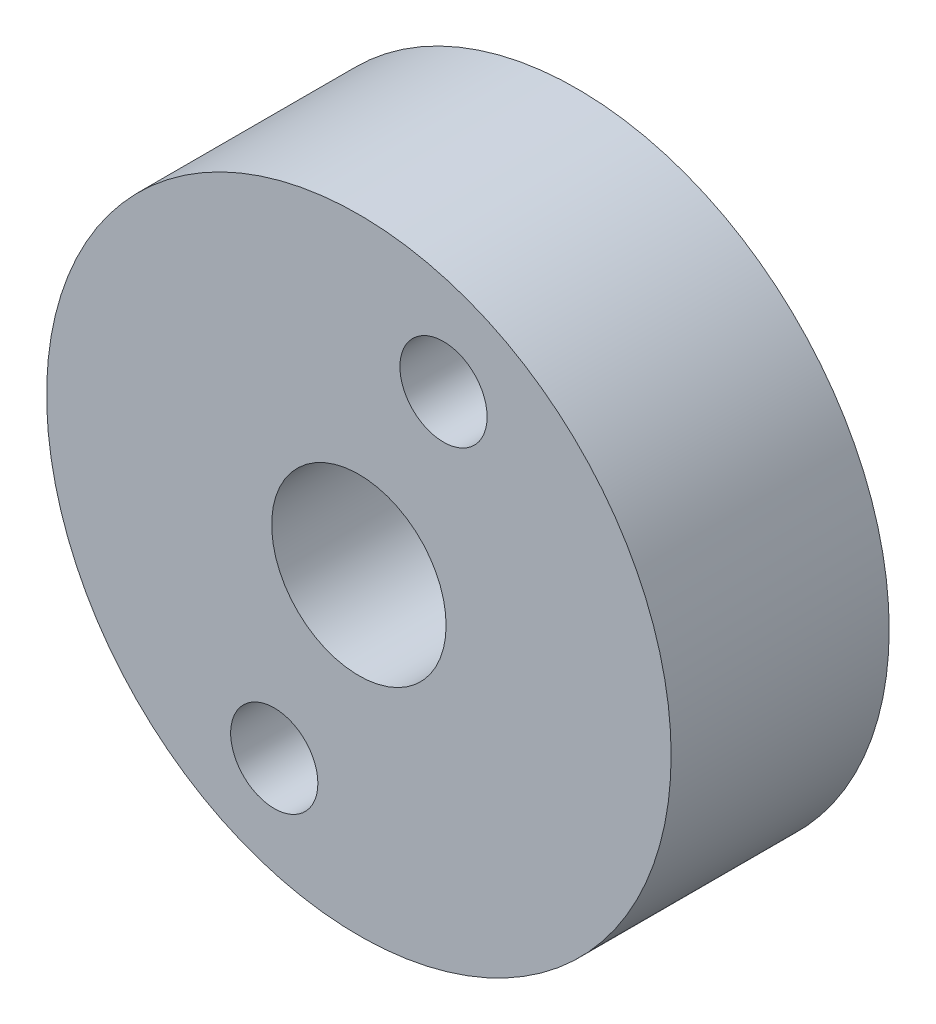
ISO-10303-21;
HEADER;
FILE_DESCRIPTION(('STEP AP214'),'2;1');
FILE_NAME('part.step','',(''),(''),'','','');
FILE_SCHEMA(('AUTOMOTIVE_DESIGN { 1 0 10303 214 1 1 1 1 }'));
ENDSEC;
DATA;
#1=APPLICATION_CONTEXT('core data for automotive mechanical design processes');
#2=APPLICATION_PROTOCOL_DEFINITION('international standard','automotive_design',2000,#1);
#3=PRODUCT_CONTEXT('',#1,'mechanical');
#4=PRODUCT('Part','Part','',(#3));
#5=PRODUCT_RELATED_PRODUCT_CATEGORY('part','',(#4));
#6=PRODUCT_DEFINITION_FORMATION('','',#4);
#7=PRODUCT_DEFINITION_CONTEXT('part definition',#1,'design');
#8=PRODUCT_DEFINITION('design','',#6,#7);
#9=PRODUCT_DEFINITION_SHAPE('','',#8);
#10=(LENGTH_UNIT() NAMED_UNIT(*) SI_UNIT(.MILLI.,.METRE.));
#11=(NAMED_UNIT(*) PLANE_ANGLE_UNIT() SI_UNIT($,.RADIAN.));
#12=(NAMED_UNIT(*) SI_UNIT($,.STERADIAN.) SOLID_ANGLE_UNIT());
#13=UNCERTAINTY_MEASURE_WITH_UNIT(LENGTH_MEASURE(1.E-05),#10,'distance_accuracy_value','');
#14=(GEOMETRIC_REPRESENTATION_CONTEXT(3) GLOBAL_UNCERTAINTY_ASSIGNED_CONTEXT((#13)) GLOBAL_UNIT_ASSIGNED_CONTEXT((#10,
#11,#12)) REPRESENTATION_CONTEXT('',''));
#15=CARTESIAN_POINT('',(0.,0.,0.));
#16=DIRECTION('',(0.,0.,1.));
#17=DIRECTION('',(1.,0.,0.));
#18=AXIS2_PLACEMENT_3D('',#15,#16,#17);
#19=CARTESIAN_POINT('',(0.,0.,5.));
#20=DIRECTION('',(0.,0.,-1.));
#21=DIRECTION('',(-1.,0.,0.));
#22=AXIS2_PLACEMENT_3D('',#19,#20,#21);
#23=CYLINDRICAL_SURFACE('',#22,7.16);
#24=CARTESIAN_POINT('',(0.,0.,5.));
#25=DIRECTION('',(0.,0.,1.));
#26=DIRECTION('',(1.,0.,0.));
#27=AXIS2_PLACEMENT_3D('',#24,#25,#26);
#28=CIRCLE('',#27,7.16);
#29=CARTESIAN_POINT('',(7.16,0.,5.));
#30=VERTEX_POINT('',#29);
#31=EDGE_CURVE('E10',#30,#30,#28,.T.);
#32=ORIENTED_EDGE('',*,*,#31,.F.);
#33=EDGE_LOOP('',(#32));
#34=FACE_BOUND('',#33,.T.);
#35=CARTESIAN_POINT('',(0.,0.,0.));
#36=DIRECTION('',(0.,0.,1.));
#37=DIRECTION('',(1.,0.,0.));
#38=AXIS2_PLACEMENT_3D('',#35,#36,#37);
#39=CIRCLE('',#38,7.16);
#40=CARTESIAN_POINT('',(7.16,0.,0.));
#41=VERTEX_POINT('',#40);
#42=EDGE_CURVE('E36',#41,#41,#39,.T.);
#43=ORIENTED_EDGE('',*,*,#42,.T.);
#44=EDGE_LOOP('',(#43));
#45=FACE_BOUND('',#44,.T.);
#46=ADVANCED_FACE('F33',(#34,#45),#23,.T.);
#47=CARTESIAN_POINT('',(0.,0.,5.));
#48=DIRECTION('',(0.,0.,1.));
#49=DIRECTION('',(1.,0.,0.));
#50=AXIS2_PLACEMENT_3D('',#47,#48,#49);
#51=PLANE('',#50);
#52=CARTESIAN_POINT('',(-1.94041736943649,-4.60812113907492,5.));
#53=DIRECTION('',(0.,0.,1.));
#54=DIRECTION('',(1.,0.,0.));
#55=AXIS2_PLACEMENT_3D('',#52,#53,#54);
#56=CIRCLE('',#55,1.);
#57=CARTESIAN_POINT('',(-0.940417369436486,-4.60812113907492,5.));
#58=VERTEX_POINT('',#57);
#59=EDGE_CURVE('E57',#58,#58,#56,.T.);
#60=ORIENTED_EDGE('',*,*,#59,.F.);
#61=EDGE_LOOP('',(#60));
#62=FACE_BOUND('',#61,.T.);
#63=CARTESIAN_POINT('',(1.94041736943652,4.60812113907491,5.));
#64=DIRECTION('',(0.,0.,1.));
#65=DIRECTION('',(1.,0.,0.));
#66=AXIS2_PLACEMENT_3D('',#63,#64,#65);
#67=CIRCLE('',#66,1.);
#68=CARTESIAN_POINT('',(2.94041736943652,4.60812113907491,5.));
#69=VERTEX_POINT('',#68);
#70=EDGE_CURVE('E51',#69,#69,#67,.T.);
#71=ORIENTED_EDGE('',*,*,#70,.F.);
#72=EDGE_LOOP('',(#71));
#73=FACE_BOUND('',#72,.T.);
#74=CARTESIAN_POINT('',(0.,0.,5.));
#75=DIRECTION('',(0.,0.,1.));
#76=DIRECTION('',(1.,0.,0.));
#77=AXIS2_PLACEMENT_3D('',#74,#75,#76);
#78=CIRCLE('',#77,2.);
#79=CARTESIAN_POINT('',(2.,0.,5.));
#80=VERTEX_POINT('',#79);
#81=EDGE_CURVE('E45',#80,#80,#78,.T.);
#82=ORIENTED_EDGE('',*,*,#81,.F.);
#83=EDGE_LOOP('',(#82));
#84=FACE_BOUND('',#83,.T.);
#85=ORIENTED_EDGE('',*,*,#31,.T.);
#86=EDGE_LOOP('',(#85));
#87=FACE_BOUND('',#86,.T.);
#88=ADVANCED_FACE('F73',(#62,#73,#84,#87),#51,.T.);
#89=CARTESIAN_POINT('',(0.,0.,0.));
#90=DIRECTION('',(0.,0.,1.));
#91=DIRECTION('',(1.,0.,0.));
#92=AXIS2_PLACEMENT_3D('',#89,#90,#91);
#93=PLANE('',#92);
#94=CARTESIAN_POINT('',(-1.94041736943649,-4.60812113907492,0.));
#95=DIRECTION('',(0.,0.,1.));
#96=DIRECTION('',(1.,0.,0.));
#97=AXIS2_PLACEMENT_3D('',#94,#95,#96);
#98=CIRCLE('',#97,1.);
#99=CARTESIAN_POINT('',(-0.940417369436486,-4.60812113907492,0.));
#100=VERTEX_POINT('',#99);
#101=EDGE_CURVE('E54',#100,#100,#98,.T.);
#102=ORIENTED_EDGE('',*,*,#101,.T.);
#103=EDGE_LOOP('',(#102));
#104=FACE_BOUND('',#103,.T.);
#105=CARTESIAN_POINT('',(1.94041736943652,4.60812113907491,0.));
#106=DIRECTION('',(0.,0.,1.));
#107=DIRECTION('',(1.,0.,0.));
#108=AXIS2_PLACEMENT_3D('',#105,#106,#107);
#109=CIRCLE('',#108,1.);
#110=CARTESIAN_POINT('',(2.94041736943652,4.60812113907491,0.));
#111=VERTEX_POINT('',#110);
#112=EDGE_CURVE('E48',#111,#111,#109,.T.);
#113=ORIENTED_EDGE('',*,*,#112,.T.);
#114=EDGE_LOOP('',(#113));
#115=FACE_BOUND('',#114,.T.);
#116=CARTESIAN_POINT('',(0.,0.,0.));
#117=DIRECTION('',(0.,0.,1.));
#118=DIRECTION('',(1.,0.,0.));
#119=AXIS2_PLACEMENT_3D('',#116,#117,#118);
#120=CIRCLE('',#119,2.);
#121=CARTESIAN_POINT('',(2.,0.,0.));
#122=VERTEX_POINT('',#121);
#123=EDGE_CURVE('E43',#122,#122,#120,.T.);
#124=ORIENTED_EDGE('',*,*,#123,.T.);
#125=EDGE_LOOP('',(#124));
#126=FACE_BOUND('',#125,.T.);
#127=ORIENTED_EDGE('',*,*,#42,.F.);
#128=EDGE_LOOP('',(#127));
#129=FACE_BOUND('',#128,.T.);
#130=ADVANCED_FACE('F63',(#104,#115,#126,#129),#93,.F.);
#131=CARTESIAN_POINT('',(0.,0.,0.));
#132=DIRECTION('',(0.,0.,1.));
#133=DIRECTION('',(1.,0.,0.));
#134=AXIS2_PLACEMENT_3D('',#131,#132,#133);
#135=CYLINDRICAL_SURFACE('',#134,2.);
#136=ORIENTED_EDGE('',*,*,#123,.F.);
#137=EDGE_LOOP('',(#136));
#138=FACE_BOUND('',#137,.T.);
#139=ORIENTED_EDGE('',*,*,#81,.T.);
#140=EDGE_LOOP('',(#139));
#141=FACE_BOUND('',#140,.T.);
#142=ADVANCED_FACE('F81',(#138,#141),#135,.F.);
#143=CARTESIAN_POINT('',(1.94041736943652,4.60812113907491,0.));
#144=DIRECTION('',(0.,0.,1.));
#145=DIRECTION('',(1.,0.,0.));
#146=AXIS2_PLACEMENT_3D('',#143,#144,#145);
#147=CYLINDRICAL_SURFACE('',#146,1.);
#148=ORIENTED_EDGE('',*,*,#112,.F.);
#149=EDGE_LOOP('',(#148));
#150=FACE_BOUND('',#149,.T.);
#151=ORIENTED_EDGE('',*,*,#70,.T.);
#152=EDGE_LOOP('',(#151));
#153=FACE_BOUND('',#152,.T.);
#154=ADVANCED_FACE('F69',(#150,#153),#147,.F.);
#155=CARTESIAN_POINT('',(-1.94041736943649,-4.60812113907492,0.));
#156=DIRECTION('',(0.,0.,1.));
#157=DIRECTION('',(1.,0.,0.));
#158=AXIS2_PLACEMENT_3D('',#155,#156,#157);
#159=CYLINDRICAL_SURFACE('',#158,1.);
#160=ORIENTED_EDGE('',*,*,#101,.F.);
#161=EDGE_LOOP('',(#160));
#162=FACE_BOUND('',#161,.T.);
#163=ORIENTED_EDGE('',*,*,#59,.T.);
#164=EDGE_LOOP('',(#163));
#165=FACE_BOUND('',#164,.T.);
#166=ADVANCED_FACE('F66',(#162,#165),#159,.F.);
#167=CLOSED_SHELL('',(#46,#88,#130,#142,#154,#166));
#168=MANIFOLD_SOLID_BREP('B2',#167);
#169=ADVANCED_BREP_SHAPE_REPRESENTATION('',(#18,#168),#14);
#170=SHAPE_DEFINITION_REPRESENTATION(#9,#169);
ENDSEC;
END-ISO-10303-21;
